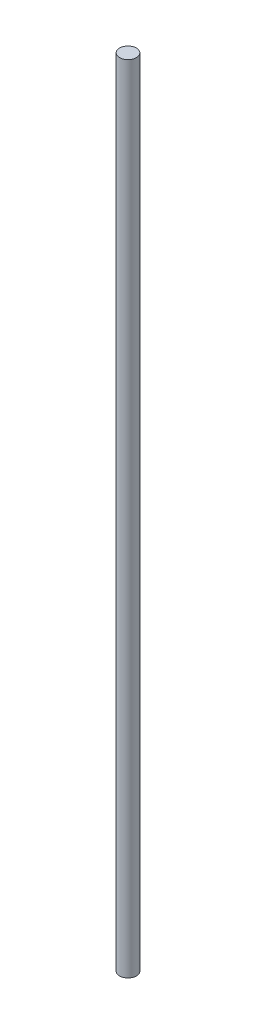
from build123d import *

# Parameters (mm, degrees)
SKETCH1_R           = 4
BOSS_EXTRUDE1_DEPTH = 380


with BuildPart() as part:
    # Sketch1 → Boss-Extrude1 (new body)
    with BuildSketch(Plane(origin=(0, 0, 0), x_dir=(1, 0, 0), z_dir=(0, 1, 0))):
        with Locations(Location((0, 0, 0), (0, 0, 270))):
            Circle(SKETCH1_R)
    extrude(amount=BOSS_EXTRUDE1_DEPTH)


solid = part.part
